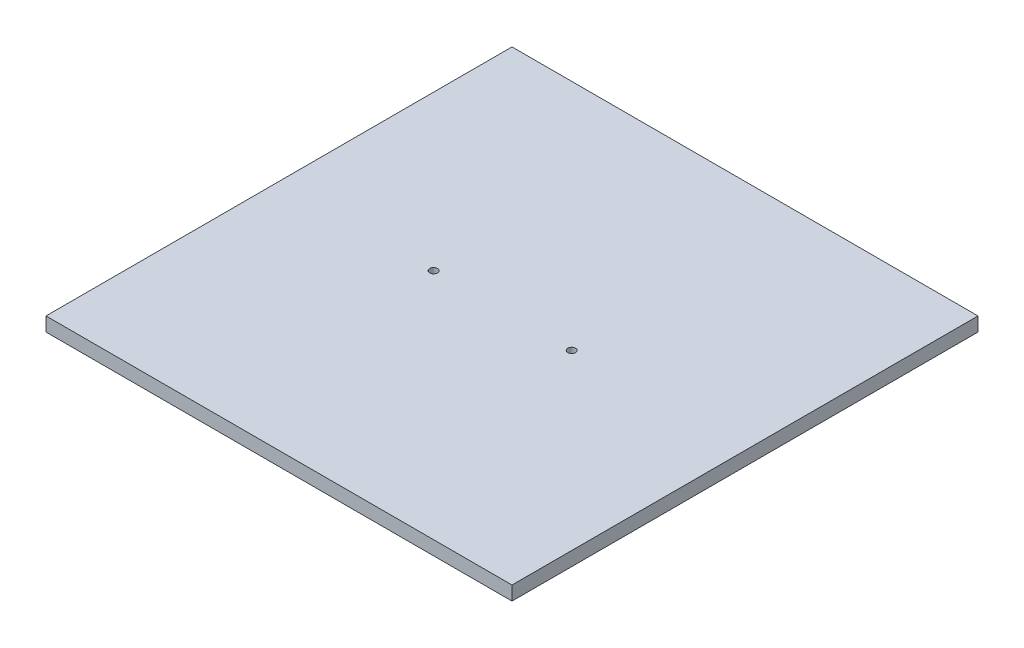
from build123d import *

# Parameters (mm, degrees)
SKETCH1_W           = 300
SKETCH1_H           = 300
SKETCH1_R           = 2.5
BOSS_EXTRUDE1_DEPTH = 9


with BuildPart() as part:
    # Sketch1 → Boss-Extrude1 (new body)
    with BuildSketch(Plane(origin=(0, 0, 0), x_dir=(1, 0, 0), z_dir=(0, 1, 0))):
        with Locations((150, 150)):
            Rectangle(SKETCH1_W, SKETCH1_H)
        with Locations(Location((99.56, 150, 0), (0, 0, 270))):
            Circle(SKETCH1_R, mode=Mode.SUBTRACT)
        with Locations(Location((188.44, 150, 0), (0, 0, 270))):
            Circle(SKETCH1_R, mode=Mode.SUBTRACT)
    extrude(amount=BOSS_EXTRUDE1_DEPTH)


solid = part.part
